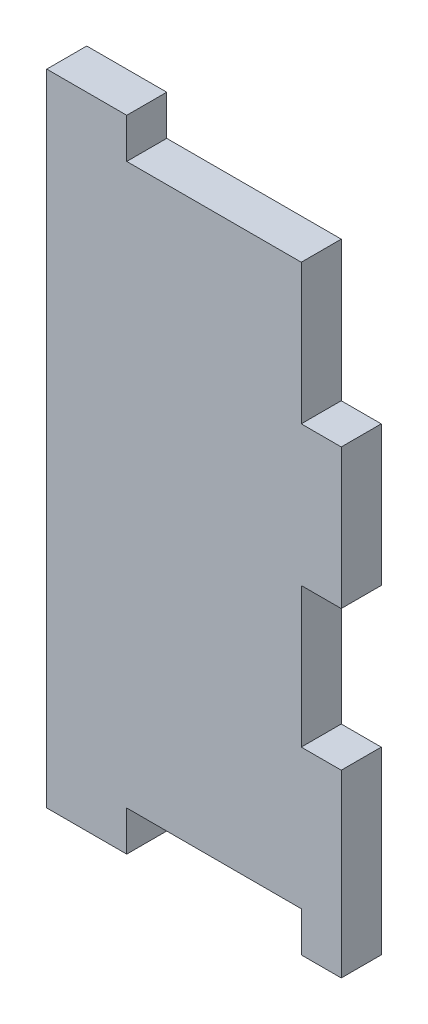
ISO-10303-21;
HEADER;
FILE_DESCRIPTION(('STEP AP214'),'2;1');
FILE_NAME('part.step','',(''),(''),'','','');
FILE_SCHEMA(('AUTOMOTIVE_DESIGN { 1 0 10303 214 1 1 1 1 }'));
ENDSEC;
DATA;
#1=APPLICATION_CONTEXT('core data for automotive mechanical design processes');
#2=APPLICATION_PROTOCOL_DEFINITION('international standard','automotive_design',2000,#1);
#3=PRODUCT_CONTEXT('',#1,'mechanical');
#4=PRODUCT('Part','Part','',(#3));
#5=PRODUCT_RELATED_PRODUCT_CATEGORY('part','',(#4));
#6=PRODUCT_DEFINITION_FORMATION('','',#4);
#7=PRODUCT_DEFINITION_CONTEXT('part definition',#1,'design');
#8=PRODUCT_DEFINITION('design','',#6,#7);
#9=PRODUCT_DEFINITION_SHAPE('','',#8);
#10=(LENGTH_UNIT() NAMED_UNIT(*) SI_UNIT(.MILLI.,.METRE.));
#11=(NAMED_UNIT(*) PLANE_ANGLE_UNIT() SI_UNIT($,.RADIAN.));
#12=(NAMED_UNIT(*) SI_UNIT($,.STERADIAN.) SOLID_ANGLE_UNIT());
#13=UNCERTAINTY_MEASURE_WITH_UNIT(LENGTH_MEASURE(1.E-05),#10,'distance_accuracy_value','');
#14=(GEOMETRIC_REPRESENTATION_CONTEXT(3) GLOBAL_UNCERTAINTY_ASSIGNED_CONTEXT((#13)) GLOBAL_UNIT_ASSIGNED_CONTEXT((#10,
#11,#12)) REPRESENTATION_CONTEXT('',''));
#15=CARTESIAN_POINT('',(0.,0.,0.));
#16=DIRECTION('',(0.,0.,1.));
#17=DIRECTION('',(1.,0.,0.));
#18=AXIS2_PLACEMENT_3D('',#15,#16,#17);
#19=CARTESIAN_POINT('',(23.3807,-50.8,6.35));
#20=DIRECTION('',(-1.,0.,0.));
#21=DIRECTION('',(0.,0.,1.));
#22=AXIS2_PLACEMENT_3D('',#19,#20,#21);
#23=PLANE('',#22);
#24=DIRECTION('',(0.,1.,0.));
#25=VECTOR('',#24,1.);
#26=CARTESIAN_POINT('',(23.3807,-50.8,0.));
#27=LINE('',#26,#25);
#28=CARTESIAN_POINT('',(23.3807,-50.8,0.));
#29=VERTEX_POINT('',#28);
#30=CARTESIAN_POINT('',(23.3807,-22.225,0.));
#31=VERTEX_POINT('',#30);
#32=EDGE_CURVE('E163',#29,#31,#27,.T.);
#33=ORIENTED_EDGE('',*,*,#32,.T.);
#34=DIRECTION('',(0.,0.,1.));
#35=VECTOR('',#34,1.);
#36=CARTESIAN_POINT('',(23.3807,-22.225,0.));
#37=LINE('',#36,#35);
#38=CARTESIAN_POINT('',(23.3807,-22.225,6.35));
#39=VERTEX_POINT('',#38);
#40=EDGE_CURVE('E268',#31,#39,#37,.T.);
#41=ORIENTED_EDGE('',*,*,#40,.T.);
#42=DIRECTION('',(0.,1.,0.));
#43=VECTOR('',#42,1.);
#44=CARTESIAN_POINT('',(23.3807,-50.8,6.35));
#45=LINE('',#44,#43);
#46=CARTESIAN_POINT('',(23.3807,-50.8,6.35));
#47=VERTEX_POINT('',#46);
#48=EDGE_CURVE('E261',#47,#39,#45,.T.);
#49=ORIENTED_EDGE('',*,*,#48,.F.);
#50=DIRECTION('',(0.,0.,-1.));
#51=VECTOR('',#50,1.);
#52=CARTESIAN_POINT('',(23.3807,-50.8,6.35));
#53=LINE('',#52,#51);
#54=EDGE_CURVE('E191',#47,#29,#53,.T.);
#55=ORIENTED_EDGE('',*,*,#54,.T.);
#56=EDGE_LOOP('',(#33,#41,#49,#55));
#57=FACE_BOUND('',#56,.T.);
#58=ADVANCED_FACE('F32',(#57),#23,.F.);
#59=CARTESIAN_POINT('',(23.3807,0.,6.35));
#60=VERTEX_POINT('',#59);
#61=CARTESIAN_POINT('',(23.3807,22.225,6.35));
#62=VERTEX_POINT('',#61);
#63=EDGE_CURVE('E156',#60,#62,#45,.T.);
#64=ORIENTED_EDGE('',*,*,#63,.F.);
#65=DIRECTION('',(0.,0.,1.));
#66=VECTOR('',#65,1.);
#67=CARTESIAN_POINT('',(23.3807,0.,0.));
#68=LINE('',#67,#66);
#69=CARTESIAN_POINT('',(23.3807,0.,0.));
#70=VERTEX_POINT('',#69);
#71=EDGE_CURVE('E149',#70,#60,#68,.T.);
#72=ORIENTED_EDGE('',*,*,#71,.F.);
#73=CARTESIAN_POINT('',(23.3807,22.225,0.));
#74=VERTEX_POINT('',#73);
#75=EDGE_CURVE('E55',#70,#74,#27,.T.);
#76=ORIENTED_EDGE('',*,*,#75,.T.);
#77=DIRECTION('',(0.,0.,1.));
#78=VECTOR('',#77,1.);
#79=CARTESIAN_POINT('',(23.3807,22.225,0.));
#80=LINE('',#79,#78);
#81=EDGE_CURVE('E164',#74,#62,#80,.T.);
#82=ORIENTED_EDGE('',*,*,#81,.T.);
#83=EDGE_LOOP('',(#64,#72,#76,#82));
#84=FACE_BOUND('',#83,.T.);
#85=ADVANCED_FACE('F34',(#84),#23,.F.);
#86=CARTESIAN_POINT('',(17.0307,44.45,6.35));
#87=DIRECTION('',(0.,-1.,0.));
#88=DIRECTION('',(0.,0.,-1.));
#89=AXIS2_PLACEMENT_3D('',#86,#87,#88);
#90=PLANE('',#89);
#91=DIRECTION('',(-1.,0.,0.));
#92=VECTOR('',#91,1.);
#93=CARTESIAN_POINT('',(17.0307,44.45,0.));
#94=LINE('',#93,#92);
#95=CARTESIAN_POINT('',(17.0307,44.45,0.));
#96=VERTEX_POINT('',#95);
#97=CARTESIAN_POINT('',(-10.6807,44.45,0.));
#98=VERTEX_POINT('',#97);
#99=EDGE_CURVE('E167',#96,#98,#94,.T.);
#100=ORIENTED_EDGE('',*,*,#99,.T.);
#101=DIRECTION('',(0.,0.,-1.));
#102=VECTOR('',#101,1.);
#103=CARTESIAN_POINT('',(-10.6807,44.45,6.35));
#104=LINE('',#103,#102);
#105=CARTESIAN_POINT('',(-10.6807,44.45,6.35));
#106=VERTEX_POINT('',#105);
#107=EDGE_CURVE('E215',#106,#98,#104,.T.);
#108=ORIENTED_EDGE('',*,*,#107,.F.);
#109=DIRECTION('',(-1.,0.,0.));
#110=VECTOR('',#109,1.);
#111=CARTESIAN_POINT('',(17.0307,44.45,6.35));
#112=LINE('',#111,#110);
#113=CARTESIAN_POINT('',(17.0307,44.45,6.35));
#114=VERTEX_POINT('',#113);
#115=EDGE_CURVE('E223',#114,#106,#112,.T.);
#116=ORIENTED_EDGE('',*,*,#115,.F.);
#117=DIRECTION('',(0.,0.,-1.));
#118=VECTOR('',#117,1.);
#119=CARTESIAN_POINT('',(17.0307,44.45,6.35));
#120=LINE('',#119,#118);
#121=EDGE_CURVE('E40',#114,#96,#120,.T.);
#122=ORIENTED_EDGE('',*,*,#121,.T.);
#123=EDGE_LOOP('',(#100,#108,#116,#122));
#124=FACE_BOUND('',#123,.T.);
#125=ADVANCED_FACE('F221',(#124),#90,.F.);
#126=CARTESIAN_POINT('',(-10.6807,44.45,6.35));
#127=DIRECTION('',(-1.,0.,0.));
#128=DIRECTION('',(0.,-1.,0.));
#129=AXIS2_PLACEMENT_3D('',#126,#127,#128);
#130=PLANE('',#129);
#131=DIRECTION('',(0.,1.,0.));
#132=VECTOR('',#131,1.);
#133=CARTESIAN_POINT('',(-10.6807,44.45,0.));
#134=LINE('',#133,#132);
#135=CARTESIAN_POINT('',(-10.6807,50.8,0.));
#136=VERTEX_POINT('',#135);
#137=EDGE_CURVE('E175',#98,#136,#134,.T.);
#138=ORIENTED_EDGE('',*,*,#137,.T.);
#139=DIRECTION('',(0.,0.,-1.));
#140=VECTOR('',#139,1.);
#141=CARTESIAN_POINT('',(-10.6807,50.8,6.35));
#142=LINE('',#141,#140);
#143=CARTESIAN_POINT('',(-10.6807,50.8,6.35));
#144=VERTEX_POINT('',#143);
#145=EDGE_CURVE('E212',#144,#136,#142,.T.);
#146=ORIENTED_EDGE('',*,*,#145,.F.);
#147=DIRECTION('',(0.,1.,0.));
#148=VECTOR('',#147,1.);
#149=CARTESIAN_POINT('',(-10.6807,44.45,6.35));
#150=LINE('',#149,#148);
#151=EDGE_CURVE('E241',#106,#144,#150,.T.);
#152=ORIENTED_EDGE('',*,*,#151,.F.);
#153=ORIENTED_EDGE('',*,*,#107,.T.);
#154=EDGE_LOOP('',(#138,#146,#152,#153));
#155=FACE_BOUND('',#154,.T.);
#156=ADVANCED_FACE('F231',(#155),#130,.F.);
#157=CARTESIAN_POINT('',(-10.6807,50.8,6.35));
#158=DIRECTION('',(0.,-1.,0.));
#159=DIRECTION('',(0.,0.,-1.));
#160=AXIS2_PLACEMENT_3D('',#157,#158,#159);
#161=PLANE('',#160);
#162=DIRECTION('',(-1.,0.,0.));
#163=VECTOR('',#162,1.);
#164=CARTESIAN_POINT('',(-10.6807,50.8,0.));
#165=LINE('',#164,#163);
#166=CARTESIAN_POINT('',(-23.3807,50.8,0.));
#167=VERTEX_POINT('',#166);
#168=EDGE_CURVE('E177',#136,#167,#165,.T.);
#169=ORIENTED_EDGE('',*,*,#168,.T.);
#170=DIRECTION('',(0.,0.,-1.));
#171=VECTOR('',#170,1.);
#172=CARTESIAN_POINT('',(-23.3807,50.8,6.35));
#173=LINE('',#172,#171);
#174=CARTESIAN_POINT('',(-23.3807,50.8,6.35));
#175=VERTEX_POINT('',#174);
#176=EDGE_CURVE('E209',#175,#167,#173,.T.);
#177=ORIENTED_EDGE('',*,*,#176,.F.);
#178=DIRECTION('',(-1.,0.,0.));
#179=VECTOR('',#178,1.);
#180=CARTESIAN_POINT('',(-10.6807,50.8,6.35));
#181=LINE('',#180,#179);
#182=EDGE_CURVE('E237',#144,#175,#181,.T.);
#183=ORIENTED_EDGE('',*,*,#182,.F.);
#184=ORIENTED_EDGE('',*,*,#145,.T.);
#185=EDGE_LOOP('',(#169,#177,#183,#184));
#186=FACE_BOUND('',#185,.T.);
#187=ADVANCED_FACE('F235',(#186),#161,.F.);
#188=CARTESIAN_POINT('',(-23.3807,50.8,6.35));
#189=DIRECTION('',(1.,0.,0.));
#190=DIRECTION('',(0.,1.,0.));
#191=AXIS2_PLACEMENT_3D('',#188,#189,#190);
#192=PLANE('',#191);
#193=DIRECTION('',(0.,-1.,0.));
#194=VECTOR('',#193,1.);
#195=CARTESIAN_POINT('',(-23.3807,50.8,0.));
#196=LINE('',#195,#194);
#197=CARTESIAN_POINT('',(-23.3807,-50.8,0.));
#198=VERTEX_POINT('',#197);
#199=EDGE_CURVE('E179',#167,#198,#196,.T.);
#200=ORIENTED_EDGE('',*,*,#199,.T.);
#201=DIRECTION('',(0.,0.,-1.));
#202=VECTOR('',#201,1.);
#203=CARTESIAN_POINT('',(-23.3807,-50.8,6.35));
#204=LINE('',#203,#202);
#205=CARTESIAN_POINT('',(-23.3807,-50.8,6.35));
#206=VERTEX_POINT('',#205);
#207=EDGE_CURVE('E206',#206,#198,#204,.T.);
#208=ORIENTED_EDGE('',*,*,#207,.F.);
#209=DIRECTION('',(0.,-1.,0.));
#210=VECTOR('',#209,1.);
#211=CARTESIAN_POINT('',(-23.3807,50.8,6.35));
#212=LINE('',#211,#210);
#213=EDGE_CURVE('E240',#175,#206,#212,.T.);
#214=ORIENTED_EDGE('',*,*,#213,.F.);
#215=ORIENTED_EDGE('',*,*,#176,.T.);
#216=EDGE_LOOP('',(#200,#208,#214,#215));
#217=FACE_BOUND('',#216,.T.);
#218=ADVANCED_FACE('F319',(#217),#192,.F.);
#219=CARTESIAN_POINT('',(-23.3807,-50.8,6.35));
#220=DIRECTION('',(0.,1.,0.));
#221=DIRECTION('',(0.,0.,1.));
#222=AXIS2_PLACEMENT_3D('',#219,#220,#221);
#223=PLANE('',#222);
#224=DIRECTION('',(1.,0.,0.));
#225=VECTOR('',#224,1.);
#226=CARTESIAN_POINT('',(-23.3807,-50.8,0.));
#227=LINE('',#226,#225);
#228=CARTESIAN_POINT('',(-10.6807,-50.8,0.));
#229=VERTEX_POINT('',#228);
#230=EDGE_CURVE('E181',#198,#229,#227,.T.);
#231=ORIENTED_EDGE('',*,*,#230,.T.);
#232=DIRECTION('',(0.,0.,-1.));
#233=VECTOR('',#232,1.);
#234=CARTESIAN_POINT('',(-10.6807,-50.8,6.35));
#235=LINE('',#234,#233);
#236=CARTESIAN_POINT('',(-10.6807,-50.8,6.35));
#237=VERTEX_POINT('',#236);
#238=EDGE_CURVE('E203',#237,#229,#235,.T.);
#239=ORIENTED_EDGE('',*,*,#238,.F.);
#240=DIRECTION('',(1.,0.,0.));
#241=VECTOR('',#240,1.);
#242=CARTESIAN_POINT('',(-23.3807,-50.8,6.35));
#243=LINE('',#242,#241);
#244=EDGE_CURVE('E243',#206,#237,#243,.T.);
#245=ORIENTED_EDGE('',*,*,#244,.F.);
#246=ORIENTED_EDGE('',*,*,#207,.T.);
#247=EDGE_LOOP('',(#231,#239,#245,#246));
#248=FACE_BOUND('',#247,.T.);
#249=ADVANCED_FACE('F322',(#248),#223,.F.);
#250=CARTESIAN_POINT('',(-10.6807,-50.8,6.35));
#251=DIRECTION('',(-1.,0.,0.));
#252=DIRECTION('',(0.,0.,1.));
#253=AXIS2_PLACEMENT_3D('',#250,#251,#252);
#254=PLANE('',#253);
#255=DIRECTION('',(0.,1.,0.));
#256=VECTOR('',#255,1.);
#257=CARTESIAN_POINT('',(-10.6807,-50.8,0.));
#258=LINE('',#257,#256);
#259=CARTESIAN_POINT('',(-10.6807,-44.45,0.));
#260=VERTEX_POINT('',#259);
#261=EDGE_CURVE('E183',#229,#260,#258,.T.);
#262=ORIENTED_EDGE('',*,*,#261,.T.);
#263=DIRECTION('',(0.,0.,-1.));
#264=VECTOR('',#263,1.);
#265=CARTESIAN_POINT('',(-10.6807,-44.45,6.35));
#266=LINE('',#265,#264);
#267=CARTESIAN_POINT('',(-10.6807,-44.45,6.35));
#268=VERTEX_POINT('',#267);
#269=EDGE_CURVE('E200',#268,#260,#266,.T.);
#270=ORIENTED_EDGE('',*,*,#269,.F.);
#271=DIRECTION('',(0.,1.,0.));
#272=VECTOR('',#271,1.);
#273=CARTESIAN_POINT('',(-10.6807,-50.8,6.35));
#274=LINE('',#273,#272);
#275=EDGE_CURVE('E249',#237,#268,#274,.T.);
#276=ORIENTED_EDGE('',*,*,#275,.F.);
#277=ORIENTED_EDGE('',*,*,#238,.T.);
#278=EDGE_LOOP('',(#262,#270,#276,#277));
#279=FACE_BOUND('',#278,.T.);
#280=ADVANCED_FACE('F326',(#279),#254,.F.);
#281=CARTESIAN_POINT('',(-10.6807,-44.45,6.35));
#282=DIRECTION('',(0.,1.,0.));
#283=DIRECTION('',(-1.,0.,0.));
#284=AXIS2_PLACEMENT_3D('',#281,#282,#283);
#285=PLANE('',#284);
#286=DIRECTION('',(1.,0.,0.));
#287=VECTOR('',#286,1.);
#288=CARTESIAN_POINT('',(-10.6807,-44.45,0.));
#289=LINE('',#288,#287);
#290=CARTESIAN_POINT('',(17.0307,-44.45,0.));
#291=VERTEX_POINT('',#290);
#292=EDGE_CURVE('E185',#260,#291,#289,.T.);
#293=ORIENTED_EDGE('',*,*,#292,.T.);
#294=DIRECTION('',(0.,0.,-1.));
#295=VECTOR('',#294,1.);
#296=CARTESIAN_POINT('',(17.0307,-44.45,6.35));
#297=LINE('',#296,#295);
#298=CARTESIAN_POINT('',(17.0307,-44.45,6.35));
#299=VERTEX_POINT('',#298);
#300=EDGE_CURVE('E197',#299,#291,#297,.T.);
#301=ORIENTED_EDGE('',*,*,#300,.F.);
#302=DIRECTION('',(1.,0.,0.));
#303=VECTOR('',#302,1.);
#304=CARTESIAN_POINT('',(-10.6807,-44.45,6.35));
#305=LINE('',#304,#303);
#306=EDGE_CURVE('E251',#268,#299,#305,.T.);
#307=ORIENTED_EDGE('',*,*,#306,.F.);
#308=ORIENTED_EDGE('',*,*,#269,.T.);
#309=EDGE_LOOP('',(#293,#301,#307,#308));
#310=FACE_BOUND('',#309,.T.);
#311=ADVANCED_FACE('F330',(#310),#285,.F.);
#312=CARTESIAN_POINT('',(17.0307,-44.45,6.35));
#313=DIRECTION('',(1.,0.,0.));
#314=DIRECTION('',(0.,0.,-1.));
#315=AXIS2_PLACEMENT_3D('',#312,#313,#314);
#316=PLANE('',#315);
#317=DIRECTION('',(0.,-1.,0.));
#318=VECTOR('',#317,1.);
#319=CARTESIAN_POINT('',(17.0307,-44.45,0.));
#320=LINE('',#319,#318);
#321=CARTESIAN_POINT('',(17.0307,-50.8,0.));
#322=VERTEX_POINT('',#321);
#323=EDGE_CURVE('E187',#291,#322,#320,.T.);
#324=ORIENTED_EDGE('',*,*,#323,.T.);
#325=DIRECTION('',(0.,0.,-1.));
#326=VECTOR('',#325,1.);
#327=CARTESIAN_POINT('',(17.0307,-50.8,6.35));
#328=LINE('',#327,#326);
#329=CARTESIAN_POINT('',(17.0307,-50.8,6.35));
#330=VERTEX_POINT('',#329);
#331=EDGE_CURVE('E194',#330,#322,#328,.T.);
#332=ORIENTED_EDGE('',*,*,#331,.F.);
#333=DIRECTION('',(0.,-1.,0.));
#334=VECTOR('',#333,1.);
#335=CARTESIAN_POINT('',(17.0307,-44.45,6.35));
#336=LINE('',#335,#334);
#337=EDGE_CURVE('E252',#299,#330,#336,.T.);
#338=ORIENTED_EDGE('',*,*,#337,.F.);
#339=ORIENTED_EDGE('',*,*,#300,.T.);
#340=EDGE_LOOP('',(#324,#332,#338,#339));
#341=FACE_BOUND('',#340,.T.);
#342=ADVANCED_FACE('F334',(#341),#316,.F.);
#343=CARTESIAN_POINT('',(17.0307,-50.8,6.35));
#344=DIRECTION('',(0.,1.,0.));
#345=DIRECTION('',(0.,0.,1.));
#346=AXIS2_PLACEMENT_3D('',#343,#344,#345);
#347=PLANE('',#346);
#348=DIRECTION('',(1.,0.,0.));
#349=VECTOR('',#348,1.);
#350=CARTESIAN_POINT('',(17.0307,-50.8,0.));
#351=LINE('',#350,#349);
#352=EDGE_CURVE('E189',#322,#29,#351,.T.);
#353=ORIENTED_EDGE('',*,*,#352,.T.);
#354=ORIENTED_EDGE('',*,*,#54,.F.);
#355=DIRECTION('',(1.,0.,0.));
#356=VECTOR('',#355,1.);
#357=CARTESIAN_POINT('',(17.0307,-50.8,6.35));
#358=LINE('',#357,#356);
#359=EDGE_CURVE('E172',#330,#47,#358,.T.);
#360=ORIENTED_EDGE('',*,*,#359,.F.);
#361=ORIENTED_EDGE('',*,*,#331,.T.);
#362=EDGE_LOOP('',(#353,#354,#360,#361));
#363=FACE_BOUND('',#362,.T.);
#364=ADVANCED_FACE('F263',(#363),#347,.F.);
#365=CARTESIAN_POINT('',(0.,0.,6.35));
#366=DIRECTION('',(0.,0.,1.));
#367=DIRECTION('',(1.,0.,0.));
#368=AXIS2_PLACEMENT_3D('',#365,#366,#367);
#369=PLANE('',#368);
#370=DIRECTION('',(1.,0.,0.));
#371=VECTOR('',#370,1.);
#372=CARTESIAN_POINT('',(23.3807,-22.225,6.35));
#373=LINE('',#372,#371);
#374=CARTESIAN_POINT('',(17.0307,-22.225,6.35));
#375=VERTEX_POINT('',#374);
#376=EDGE_CURVE('E153',#375,#39,#373,.T.);
#377=ORIENTED_EDGE('',*,*,#376,.F.);
#378=DIRECTION('',(0.,-1.,0.));
#379=VECTOR('',#378,1.);
#380=CARTESIAN_POINT('',(17.0307,0.,6.35));
#381=LINE('',#380,#379);
#382=CARTESIAN_POINT('',(17.0307,0.,6.35));
#383=VERTEX_POINT('',#382);
#384=EDGE_CURVE('E284',#383,#375,#381,.T.);
#385=ORIENTED_EDGE('',*,*,#384,.F.);
#386=DIRECTION('',(-1.,0.,0.));
#387=VECTOR('',#386,1.);
#388=CARTESIAN_POINT('',(23.3807,0.,6.35));
#389=LINE('',#388,#387);
#390=EDGE_CURVE('E287',#60,#383,#389,.T.);
#391=ORIENTED_EDGE('',*,*,#390,.F.);
#392=ORIENTED_EDGE('',*,*,#63,.T.);
#393=DIRECTION('',(1.,0.,0.));
#394=VECTOR('',#393,1.);
#395=CARTESIAN_POINT('',(17.0307,22.225,6.35));
#396=LINE('',#395,#394);
#397=CARTESIAN_POINT('',(17.0307,22.225,6.35));
#398=VERTEX_POINT('',#397);
#399=EDGE_CURVE('E273',#398,#62,#396,.T.);
#400=ORIENTED_EDGE('',*,*,#399,.F.);
#401=DIRECTION('',(0.,-1.,0.));
#402=VECTOR('',#401,1.);
#403=CARTESIAN_POINT('',(17.0307,50.8,6.35));
#404=LINE('',#403,#402);
#405=EDGE_CURVE('E276',#114,#398,#404,.T.);
#406=ORIENTED_EDGE('',*,*,#405,.F.);
#407=ORIENTED_EDGE('',*,*,#115,.T.);
#408=ORIENTED_EDGE('',*,*,#151,.T.);
#409=ORIENTED_EDGE('',*,*,#182,.T.);
#410=ORIENTED_EDGE('',*,*,#213,.T.);
#411=ORIENTED_EDGE('',*,*,#244,.T.);
#412=ORIENTED_EDGE('',*,*,#275,.T.);
#413=ORIENTED_EDGE('',*,*,#306,.T.);
#414=ORIENTED_EDGE('',*,*,#337,.T.);
#415=ORIENTED_EDGE('',*,*,#359,.T.);
#416=ORIENTED_EDGE('',*,*,#48,.T.);
#417=EDGE_LOOP('',(#377,#385,#391,#392,#400,#406,#407,#408,#409,#410,#411,#412,#413,#414,#415,#416));
#418=FACE_BOUND('',#417,.T.);
#419=ADVANCED_FACE('F259',(#418),#369,.T.);
#420=CARTESIAN_POINT('',(0.,0.,0.));
#421=DIRECTION('',(0.,0.,1.));
#422=DIRECTION('',(1.,0.,0.));
#423=AXIS2_PLACEMENT_3D('',#420,#421,#422);
#424=PLANE('',#423);
#425=DIRECTION('',(0.,-1.,0.));
#426=VECTOR('',#425,1.);
#427=CARTESIAN_POINT('',(17.0307,0.,0.));
#428=LINE('',#427,#426);
#429=CARTESIAN_POINT('',(17.0307,0.,0.));
#430=VERTEX_POINT('',#429);
#431=CARTESIAN_POINT('',(17.0307,-22.225,0.));
#432=VERTEX_POINT('',#431);
#433=EDGE_CURVE('E47',#430,#432,#428,.T.);
#434=ORIENTED_EDGE('',*,*,#433,.T.);
#435=DIRECTION('',(1.,0.,0.));
#436=VECTOR('',#435,1.);
#437=CARTESIAN_POINT('',(23.3807,-22.225,0.));
#438=LINE('',#437,#436);
#439=EDGE_CURVE('E157',#432,#31,#438,.T.);
#440=ORIENTED_EDGE('',*,*,#439,.T.);
#441=ORIENTED_EDGE('',*,*,#32,.F.);
#442=ORIENTED_EDGE('',*,*,#352,.F.);
#443=ORIENTED_EDGE('',*,*,#323,.F.);
#444=ORIENTED_EDGE('',*,*,#292,.F.);
#445=ORIENTED_EDGE('',*,*,#261,.F.);
#446=ORIENTED_EDGE('',*,*,#230,.F.);
#447=ORIENTED_EDGE('',*,*,#199,.F.);
#448=ORIENTED_EDGE('',*,*,#168,.F.);
#449=ORIENTED_EDGE('',*,*,#137,.F.);
#450=ORIENTED_EDGE('',*,*,#99,.F.);
#451=DIRECTION('',(0.,-1.,0.));
#452=VECTOR('',#451,1.);
#453=CARTESIAN_POINT('',(17.0307,0.,0.));
#454=LINE('',#453,#452);
#455=CARTESIAN_POINT('',(17.0307,22.225,0.));
#456=VERTEX_POINT('',#455);
#457=EDGE_CURVE('E11',#96,#456,#454,.T.);
#458=ORIENTED_EDGE('',*,*,#457,.T.);
#459=DIRECTION('',(1.,0.,0.));
#460=VECTOR('',#459,1.);
#461=CARTESIAN_POINT('',(17.0307,22.225,0.));
#462=LINE('',#461,#460);
#463=EDGE_CURVE('E162',#456,#74,#462,.T.);
#464=ORIENTED_EDGE('',*,*,#463,.T.);
#465=ORIENTED_EDGE('',*,*,#75,.F.);
#466=DIRECTION('',(-1.,0.,0.));
#467=VECTOR('',#466,1.);
#468=CARTESIAN_POINT('',(23.3807,0.,0.));
#469=LINE('',#468,#467);
#470=EDGE_CURVE('E146',#70,#430,#469,.T.);
#471=ORIENTED_EDGE('',*,*,#470,.T.);
#472=EDGE_LOOP('',(#434,#440,#441,#442,#443,#444,#445,#446,#447,#448,#449,#450,#458,#464,#465,#471));
#473=FACE_BOUND('',#472,.T.);
#474=ADVANCED_FACE('F160',(#473),#424,.F.);
#475=CARTESIAN_POINT('',(17.0307,50.8,0.));
#476=DIRECTION('',(-1.,0.,0.));
#477=DIRECTION('',(0.,-1.,0.));
#478=AXIS2_PLACEMENT_3D('',#475,#476,#477);
#479=PLANE('',#478);
#480=ORIENTED_EDGE('',*,*,#405,.T.);
#481=DIRECTION('',(0.,0.,1.));
#482=VECTOR('',#481,1.);
#483=CARTESIAN_POINT('',(17.0307,22.225,0.));
#484=LINE('',#483,#482);
#485=EDGE_CURVE('E168',#456,#398,#484,.T.);
#486=ORIENTED_EDGE('',*,*,#485,.F.);
#487=ORIENTED_EDGE('',*,*,#457,.F.);
#488=ORIENTED_EDGE('',*,*,#121,.F.);
#489=EDGE_LOOP('',(#480,#486,#487,#488));
#490=FACE_BOUND('',#489,.T.);
#491=ADVANCED_FACE('F343',(#490),#479,.F.);
#492=CARTESIAN_POINT('',(17.0307,22.225,0.));
#493=DIRECTION('',(0.,-1.,0.));
#494=DIRECTION('',(0.,0.,-1.));
#495=AXIS2_PLACEMENT_3D('',#492,#493,#494);
#496=PLANE('',#495);
#497=ORIENTED_EDGE('',*,*,#399,.T.);
#498=ORIENTED_EDGE('',*,*,#81,.F.);
#499=ORIENTED_EDGE('',*,*,#463,.F.);
#500=ORIENTED_EDGE('',*,*,#485,.T.);
#501=EDGE_LOOP('',(#497,#498,#499,#500));
#502=FACE_BOUND('',#501,.T.);
#503=ADVANCED_FACE('F303',(#502),#496,.F.);
#504=CARTESIAN_POINT('',(23.3807,-22.225,0.));
#505=DIRECTION('',(0.,-1.,0.));
#506=DIRECTION('',(0.,0.,-1.));
#507=AXIS2_PLACEMENT_3D('',#504,#505,#506);
#508=PLANE('',#507);
#509=ORIENTED_EDGE('',*,*,#376,.T.);
#510=ORIENTED_EDGE('',*,*,#40,.F.);
#511=ORIENTED_EDGE('',*,*,#439,.F.);
#512=DIRECTION('',(0.,0.,1.));
#513=VECTOR('',#512,1.);
#514=CARTESIAN_POINT('',(17.0307,-22.225,0.));
#515=LINE('',#514,#513);
#516=EDGE_CURVE('E280',#432,#375,#515,.T.);
#517=ORIENTED_EDGE('',*,*,#516,.T.);
#518=EDGE_LOOP('',(#509,#510,#511,#517));
#519=FACE_BOUND('',#518,.T.);
#520=ADVANCED_FACE('F293',(#519),#508,.F.);
#521=CARTESIAN_POINT('',(17.0307,0.,0.));
#522=DIRECTION('',(-1.,0.,0.));
#523=DIRECTION('',(0.,-1.,0.));
#524=AXIS2_PLACEMENT_3D('',#521,#522,#523);
#525=PLANE('',#524);
#526=ORIENTED_EDGE('',*,*,#384,.T.);
#527=ORIENTED_EDGE('',*,*,#516,.F.);
#528=ORIENTED_EDGE('',*,*,#433,.F.);
#529=DIRECTION('',(0.,0.,1.));
#530=VECTOR('',#529,1.);
#531=CARTESIAN_POINT('',(17.0307,0.,0.));
#532=LINE('',#531,#530);
#533=EDGE_CURVE('E151',#430,#383,#532,.T.);
#534=ORIENTED_EDGE('',*,*,#533,.T.);
#535=EDGE_LOOP('',(#526,#527,#528,#534));
#536=FACE_BOUND('',#535,.T.);
#537=ADVANCED_FACE('F295',(#536),#525,.F.);
#538=CARTESIAN_POINT('',(23.3807,0.,0.));
#539=DIRECTION('',(0.,1.,0.));
#540=DIRECTION('',(-1.,0.,0.));
#541=AXIS2_PLACEMENT_3D('',#538,#539,#540);
#542=PLANE('',#541);
#543=ORIENTED_EDGE('',*,*,#390,.T.);
#544=ORIENTED_EDGE('',*,*,#533,.F.);
#545=ORIENTED_EDGE('',*,*,#470,.F.);
#546=ORIENTED_EDGE('',*,*,#71,.T.);
#547=EDGE_LOOP('',(#543,#544,#545,#546));
#548=FACE_BOUND('',#547,.T.);
#549=ADVANCED_FACE('F148',(#548),#542,.F.);
#550=CLOSED_SHELL('',(#58,#85,#125,#156,#187,#218,#249,#280,#311,#342,#364,#419,#474,#491,#503,
#520,#537,#549));
#551=MANIFOLD_SOLID_BREP('B2',#550);
#552=ADVANCED_BREP_SHAPE_REPRESENTATION('',(#18,#551),#14);
#553=SHAPE_DEFINITION_REPRESENTATION(#9,#552);
ENDSEC;
END-ISO-10303-21;
